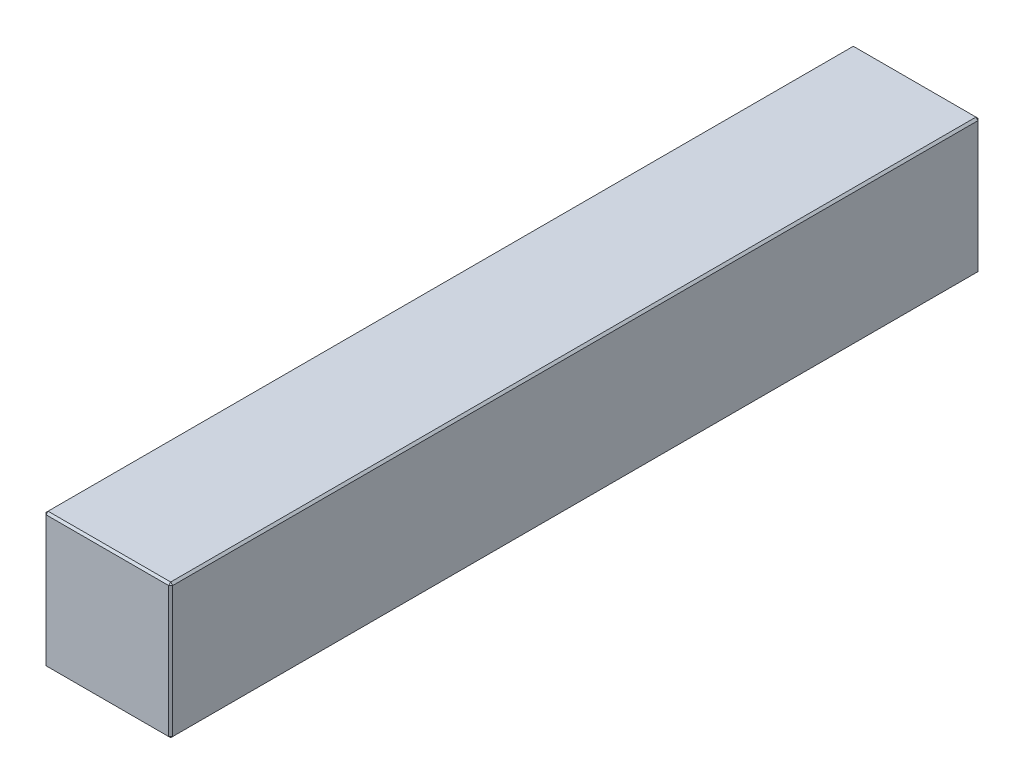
ISO-10303-21;
HEADER;
FILE_DESCRIPTION(('STEP AP214'),'2;1');
FILE_NAME('part.step','',(''),(''),'','','');
FILE_SCHEMA(('AUTOMOTIVE_DESIGN { 1 0 10303 214 1 1 1 1 }'));
ENDSEC;
DATA;
#1=APPLICATION_CONTEXT('core data for automotive mechanical design processes');
#2=APPLICATION_PROTOCOL_DEFINITION('international standard','automotive_design',2000,#1);
#3=PRODUCT_CONTEXT('',#1,'mechanical');
#4=PRODUCT('Part','Part','',(#3));
#5=PRODUCT_RELATED_PRODUCT_CATEGORY('part','',(#4));
#6=PRODUCT_DEFINITION_FORMATION('','',#4);
#7=PRODUCT_DEFINITION_CONTEXT('part definition',#1,'design');
#8=PRODUCT_DEFINITION('design','',#6,#7);
#9=PRODUCT_DEFINITION_SHAPE('','',#8);
#10=(LENGTH_UNIT() NAMED_UNIT(*) SI_UNIT(.MILLI.,.METRE.));
#11=(NAMED_UNIT(*) PLANE_ANGLE_UNIT() SI_UNIT($,.RADIAN.));
#12=(NAMED_UNIT(*) SI_UNIT($,.STERADIAN.) SOLID_ANGLE_UNIT());
#13=UNCERTAINTY_MEASURE_WITH_UNIT(LENGTH_MEASURE(1.E-05),#10,'distance_accuracy_value','');
#14=(GEOMETRIC_REPRESENTATION_CONTEXT(3) GLOBAL_UNCERTAINTY_ASSIGNED_CONTEXT((#13)) GLOBAL_UNIT_ASSIGNED_CONTEXT((#10,
#11,#12)) REPRESENTATION_CONTEXT('',''));
#15=CARTESIAN_POINT('',(0.,0.,0.));
#16=DIRECTION('',(0.,0.,1.));
#17=DIRECTION('',(1.,0.,0.));
#18=AXIS2_PLACEMENT_3D('',#15,#16,#17);
#19=CARTESIAN_POINT('',(-31.,66.,198.));
#20=DIRECTION('',(1.,0.,0.));
#21=DIRECTION('',(0.,0.,-1.));
#22=AXIS2_PLACEMENT_3D('',#19,#20,#21);
#23=PLANE('',#22);
#24=DIRECTION('',(0.,-1.,0.));
#25=VECTOR('',#24,1.);
#26=CARTESIAN_POINT('',(-31.,66.,-197.));
#27=LINE('',#26,#25);
#28=CARTESIAN_POINT('',(-31.,65.,-197.));
#29=VERTEX_POINT('',#28);
#30=CARTESIAN_POINT('',(-31.,1.,-197.));
#31=VERTEX_POINT('',#30);
#32=EDGE_CURVE('E115',#29,#31,#27,.T.);
#33=ORIENTED_EDGE('',*,*,#32,.T.);
#34=DIRECTION('',(0.,0.,1.));
#35=VECTOR('',#34,1.);
#36=CARTESIAN_POINT('',(-31.,1.,198.));
#37=LINE('',#36,#35);
#38=CARTESIAN_POINT('',(-31.,1.,197.));
#39=VERTEX_POINT('',#38);
#40=EDGE_CURVE('E111',#31,#39,#37,.T.);
#41=ORIENTED_EDGE('',*,*,#40,.T.);
#42=DIRECTION('',(0.,1.,0.));
#43=VECTOR('',#42,1.);
#44=CARTESIAN_POINT('',(-31.,66.,197.));
#45=LINE('',#44,#43);
#46=CARTESIAN_POINT('',(-31.,65.,197.));
#47=VERTEX_POINT('',#46);
#48=EDGE_CURVE('E104',#39,#47,#45,.T.);
#49=ORIENTED_EDGE('',*,*,#48,.T.);
#50=DIRECTION('',(0.,0.,-1.));
#51=VECTOR('',#50,1.);
#52=CARTESIAN_POINT('',(-31.,65.,-198.));
#53=LINE('',#52,#51);
#54=EDGE_CURVE('E108',#47,#29,#53,.T.);
#55=ORIENTED_EDGE('',*,*,#54,.T.);
#56=EDGE_LOOP('',(#33,#41,#49,#55));
#57=FACE_BOUND('',#56,.T.);
#58=ADVANCED_FACE('F16',(#57),#23,.F.);
#59=CARTESIAN_POINT('',(31.,66.,198.));
#60=DIRECTION('',(0.,0.,-1.));
#61=DIRECTION('',(-1.,0.,0.));
#62=AXIS2_PLACEMENT_3D('',#59,#60,#61);
#63=PLANE('',#62);
#64=DIRECTION('',(-1.,0.,0.));
#65=VECTOR('',#64,1.);
#66=CARTESIAN_POINT('',(-31.,65.,198.));
#67=LINE('',#66,#65);
#68=CARTESIAN_POINT('',(30.,65.,198.));
#69=VERTEX_POINT('',#68);
#70=CARTESIAN_POINT('',(-30.,65.,198.));
#71=VERTEX_POINT('',#70);
#72=EDGE_CURVE('E165',#69,#71,#67,.T.);
#73=ORIENTED_EDGE('',*,*,#72,.T.);
#74=DIRECTION('',(0.,-1.,0.));
#75=VECTOR('',#74,1.);
#76=CARTESIAN_POINT('',(-30.,66.,198.));
#77=LINE('',#76,#75);
#78=CARTESIAN_POINT('',(-30.,1.,198.));
#79=VERTEX_POINT('',#78);
#80=EDGE_CURVE('E123',#71,#79,#77,.T.);
#81=ORIENTED_EDGE('',*,*,#80,.T.);
#82=DIRECTION('',(1.,0.,0.));
#83=VECTOR('',#82,1.);
#84=CARTESIAN_POINT('',(31.,1.,198.));
#85=LINE('',#84,#83);
#86=CARTESIAN_POINT('',(30.,1.,198.));
#87=VERTEX_POINT('',#86);
#88=EDGE_CURVE('E169',#79,#87,#85,.T.);
#89=ORIENTED_EDGE('',*,*,#88,.T.);
#90=DIRECTION('',(0.,1.,0.));
#91=VECTOR('',#90,1.);
#92=CARTESIAN_POINT('',(30.,66.,198.));
#93=LINE('',#92,#91);
#94=EDGE_CURVE('E167',#87,#69,#93,.T.);
#95=ORIENTED_EDGE('',*,*,#94,.T.);
#96=EDGE_LOOP('',(#73,#81,#89,#95));
#97=FACE_BOUND('',#96,.T.);
#98=ADVANCED_FACE('F276',(#97),#63,.F.);
#99=CARTESIAN_POINT('',(31.,66.,198.));
#100=DIRECTION('',(-1.,0.,0.));
#101=DIRECTION('',(0.,0.,1.));
#102=AXIS2_PLACEMENT_3D('',#99,#100,#101);
#103=PLANE('',#102);
#104=DIRECTION('',(0.,0.,-1.));
#105=VECTOR('',#104,1.);
#106=CARTESIAN_POINT('',(31.,1.,198.));
#107=LINE('',#106,#105);
#108=CARTESIAN_POINT('',(31.,1.,197.));
#109=VERTEX_POINT('',#108);
#110=CARTESIAN_POINT('',(31.,1.,-197.));
#111=VERTEX_POINT('',#110);
#112=EDGE_CURVE('E160',#109,#111,#107,.T.);
#113=ORIENTED_EDGE('',*,*,#112,.T.);
#114=DIRECTION('',(0.,1.,0.));
#115=VECTOR('',#114,1.);
#116=CARTESIAN_POINT('',(31.,66.,-197.));
#117=LINE('',#116,#115);
#118=CARTESIAN_POINT('',(31.,65.,-197.));
#119=VERTEX_POINT('',#118);
#120=EDGE_CURVE('E162',#111,#119,#117,.T.);
#121=ORIENTED_EDGE('',*,*,#120,.T.);
#122=DIRECTION('',(0.,0.,1.));
#123=VECTOR('',#122,1.);
#124=CARTESIAN_POINT('',(31.,65.,198.));
#125=LINE('',#124,#123);
#126=CARTESIAN_POINT('',(31.,65.,197.));
#127=VERTEX_POINT('',#126);
#128=EDGE_CURVE('E156',#119,#127,#125,.T.);
#129=ORIENTED_EDGE('',*,*,#128,.T.);
#130=DIRECTION('',(0.,-1.,0.));
#131=VECTOR('',#130,1.);
#132=CARTESIAN_POINT('',(31.,66.,197.));
#133=LINE('',#132,#131);
#134=EDGE_CURVE('E158',#127,#109,#133,.T.);
#135=ORIENTED_EDGE('',*,*,#134,.T.);
#136=EDGE_LOOP('',(#113,#121,#129,#135));
#137=FACE_BOUND('',#136,.T.);
#138=ADVANCED_FACE('F255',(#137),#103,.F.);
#139=CARTESIAN_POINT('',(31.,66.,-198.));
#140=DIRECTION('',(0.,0.,1.));
#141=DIRECTION('',(1.,0.,0.));
#142=AXIS2_PLACEMENT_3D('',#139,#140,#141);
#143=PLANE('',#142);
#144=DIRECTION('',(0.,-1.,0.));
#145=VECTOR('',#144,1.);
#146=CARTESIAN_POINT('',(30.,66.,-198.));
#147=LINE('',#146,#145);
#148=CARTESIAN_POINT('',(30.,65.,-198.));
#149=VERTEX_POINT('',#148);
#150=CARTESIAN_POINT('',(30.,1.,-198.));
#151=VERTEX_POINT('',#150);
#152=EDGE_CURVE('E149',#149,#151,#147,.T.);
#153=ORIENTED_EDGE('',*,*,#152,.T.);
#154=DIRECTION('',(-1.,0.,0.));
#155=VECTOR('',#154,1.);
#156=CARTESIAN_POINT('',(31.,1.,-198.));
#157=LINE('',#156,#155);
#158=CARTESIAN_POINT('',(-30.,1.,-198.));
#159=VERTEX_POINT('',#158);
#160=EDGE_CURVE('E154',#151,#159,#157,.T.);
#161=ORIENTED_EDGE('',*,*,#160,.T.);
#162=DIRECTION('',(0.,1.,0.));
#163=VECTOR('',#162,1.);
#164=CARTESIAN_POINT('',(-30.,66.,-198.));
#165=LINE('',#164,#163);
#166=CARTESIAN_POINT('',(-30.,65.,-198.));
#167=VERTEX_POINT('',#166);
#168=EDGE_CURVE('E151',#159,#167,#165,.T.);
#169=ORIENTED_EDGE('',*,*,#168,.T.);
#170=DIRECTION('',(1.,0.,0.));
#171=VECTOR('',#170,1.);
#172=CARTESIAN_POINT('',(31.,65.,-198.));
#173=LINE('',#172,#171);
#174=EDGE_CURVE('E147',#167,#149,#173,.T.);
#175=ORIENTED_EDGE('',*,*,#174,.T.);
#176=EDGE_LOOP('',(#153,#161,#169,#175));
#177=FACE_BOUND('',#176,.T.);
#178=ADVANCED_FACE('F285',(#177),#143,.F.);
#179=CARTESIAN_POINT('',(0.,66.,0.));
#180=DIRECTION('',(0.,1.,0.));
#181=DIRECTION('',(0.,0.,1.));
#182=AXIS2_PLACEMENT_3D('',#179,#180,#181);
#183=PLANE('',#182);
#184=DIRECTION('',(0.,0.,-1.));
#185=VECTOR('',#184,1.);
#186=CARTESIAN_POINT('',(30.,66.,-198.));
#187=LINE('',#186,#185);
#188=CARTESIAN_POINT('',(30.,66.,197.));
#189=VERTEX_POINT('',#188);
#190=CARTESIAN_POINT('',(30.,66.,-197.));
#191=VERTEX_POINT('',#190);
#192=EDGE_CURVE('E25',#189,#191,#187,.T.);
#193=ORIENTED_EDGE('',*,*,#192,.T.);
#194=DIRECTION('',(-1.,0.,0.));
#195=VECTOR('',#194,1.);
#196=CARTESIAN_POINT('',(-31.,66.,-197.));
#197=LINE('',#196,#195);
#198=CARTESIAN_POINT('',(-30.,66.,-197.));
#199=VERTEX_POINT('',#198);
#200=EDGE_CURVE('E10',#191,#199,#197,.T.);
#201=ORIENTED_EDGE('',*,*,#200,.T.);
#202=DIRECTION('',(0.,0.,1.));
#203=VECTOR('',#202,1.);
#204=CARTESIAN_POINT('',(-30.,66.,198.));
#205=LINE('',#204,#203);
#206=CARTESIAN_POINT('',(-30.,66.,197.));
#207=VERTEX_POINT('',#206);
#208=EDGE_CURVE('E181',#199,#207,#205,.T.);
#209=ORIENTED_EDGE('',*,*,#208,.T.);
#210=DIRECTION('',(1.,0.,0.));
#211=VECTOR('',#210,1.);
#212=CARTESIAN_POINT('',(31.,66.,197.));
#213=LINE('',#212,#211);
#214=EDGE_CURVE('E36',#207,#189,#213,.T.);
#215=ORIENTED_EDGE('',*,*,#214,.T.);
#216=EDGE_LOOP('',(#193,#201,#209,#215));
#217=FACE_BOUND('',#216,.T.);
#218=ADVANCED_FACE('F351',(#217),#183,.T.);
#219=CARTESIAN_POINT('',(0.,0.,0.));
#220=DIRECTION('',(0.,1.,0.));
#221=DIRECTION('',(0.,0.,1.));
#222=AXIS2_PLACEMENT_3D('',#219,#220,#221);
#223=PLANE('',#222);
#224=DIRECTION('',(0.,0.,1.));
#225=VECTOR('',#224,1.);
#226=CARTESIAN_POINT('',(30.,0.,0.));
#227=LINE('',#226,#225);
#228=CARTESIAN_POINT('',(30.,0.,-197.));
#229=VERTEX_POINT('',#228);
#230=CARTESIAN_POINT('',(30.,0.,197.));
#231=VERTEX_POINT('',#230);
#232=EDGE_CURVE('E172',#229,#231,#227,.T.);
#233=ORIENTED_EDGE('',*,*,#232,.T.);
#234=DIRECTION('',(-1.,0.,0.));
#235=VECTOR('',#234,1.);
#236=CARTESIAN_POINT('',(0.,0.,197.));
#237=LINE('',#236,#235);
#238=CARTESIAN_POINT('',(-30.,0.,197.));
#239=VERTEX_POINT('',#238);
#240=EDGE_CURVE('E178',#231,#239,#237,.T.);
#241=ORIENTED_EDGE('',*,*,#240,.T.);
#242=DIRECTION('',(0.,0.,-1.));
#243=VECTOR('',#242,1.);
#244=CARTESIAN_POINT('',(-30.,0.,0.));
#245=LINE('',#244,#243);
#246=CARTESIAN_POINT('',(-30.,0.,-197.));
#247=VERTEX_POINT('',#246);
#248=EDGE_CURVE('E176',#239,#247,#245,.T.);
#249=ORIENTED_EDGE('',*,*,#248,.T.);
#250=DIRECTION('',(1.,0.,0.));
#251=VECTOR('',#250,1.);
#252=CARTESIAN_POINT('',(0.,0.,-197.));
#253=LINE('',#252,#251);
#254=EDGE_CURVE('E174',#247,#229,#253,.T.);
#255=ORIENTED_EDGE('',*,*,#254,.T.);
#256=EDGE_LOOP('',(#233,#241,#249,#255));
#257=FACE_BOUND('',#256,.T.);
#258=ADVANCED_FACE('F247',(#257),#223,.F.);
#259=CARTESIAN_POINT('',(31.,66.,197.));
#260=DIRECTION('',(-0.707106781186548,0.,-0.707106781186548));
#261=DIRECTION('',(0.,-1.,0.));
#262=AXIS2_PLACEMENT_3D('',#259,#260,#261);
#263=PLANE('',#262);
#264=DIRECTION('',(-0.707106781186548,0.,0.707106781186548));
#265=VECTOR('',#264,1.);
#266=CARTESIAN_POINT('',(30.,65.,198.));
#267=LINE('',#266,#265);
#268=EDGE_CURVE('E20',#69,#127,#267,.F.);
#269=ORIENTED_EDGE('',*,*,#268,.F.);
#270=ORIENTED_EDGE('',*,*,#94,.F.);
#271=DIRECTION('',(0.707106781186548,0.,-0.707106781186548));
#272=VECTOR('',#271,1.);
#273=CARTESIAN_POINT('',(30.,1.,198.));
#274=LINE('',#273,#272);
#275=EDGE_CURVE('E143',#109,#87,#274,.F.);
#276=ORIENTED_EDGE('',*,*,#275,.F.);
#277=ORIENTED_EDGE('',*,*,#134,.F.);
#278=EDGE_LOOP('',(#269,#270,#276,#277));
#279=FACE_BOUND('',#278,.T.);
#280=ADVANCED_FACE('F18',(#279),#263,.F.);
#281=CARTESIAN_POINT('',(30.,65.,198.));
#282=DIRECTION('',(0.577350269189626,0.577350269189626,0.577350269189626));
#283=DIRECTION('',(0.707106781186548,0.,-0.707106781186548));
#284=AXIS2_PLACEMENT_3D('',#281,#282,#283);
#285=PLANE('',#284);
#286=DIRECTION('',(0.,-0.707106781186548,0.707106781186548));
#287=VECTOR('',#286,1.);
#288=CARTESIAN_POINT('',(30.,65.,198.));
#289=LINE('',#288,#287);
#290=EDGE_CURVE('E227',#69,#189,#289,.F.);
#291=ORIENTED_EDGE('',*,*,#290,.F.);
#292=ORIENTED_EDGE('',*,*,#268,.T.);
#293=DIRECTION('',(-0.707106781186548,0.707106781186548,0.));
#294=VECTOR('',#293,1.);
#295=CARTESIAN_POINT('',(30.5,65.5,197.));
#296=LINE('',#295,#294);
#297=EDGE_CURVE('E229',#189,#127,#296,.F.);
#298=ORIENTED_EDGE('',*,*,#297,.F.);
#299=EDGE_LOOP('',(#291,#292,#298));
#300=FACE_BOUND('',#299,.T.);
#301=ADVANCED_FACE('F271',(#300),#285,.T.);
#302=CARTESIAN_POINT('',(30.,1.,198.));
#303=DIRECTION('',(0.577350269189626,-0.577350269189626,0.577350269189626));
#304=DIRECTION('',(0.707106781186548,0.,-0.707106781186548));
#305=AXIS2_PLACEMENT_3D('',#302,#303,#304);
#306=PLANE('',#305);
#307=DIRECTION('',(-0.707106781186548,-0.707106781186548,0.));
#308=VECTOR('',#307,1.);
#309=CARTESIAN_POINT('',(30.5,0.5,197.));
#310=LINE('',#309,#308);
#311=EDGE_CURVE('E221',#109,#231,#310,.T.);
#312=ORIENTED_EDGE('',*,*,#311,.F.);
#313=ORIENTED_EDGE('',*,*,#275,.T.);
#314=DIRECTION('',(0.,0.707106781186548,0.707106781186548));
#315=VECTOR('',#314,1.);
#316=CARTESIAN_POINT('',(30.,1.,198.));
#317=LINE('',#316,#315);
#318=EDGE_CURVE('E224',#231,#87,#317,.T.);
#319=ORIENTED_EDGE('',*,*,#318,.F.);
#320=EDGE_LOOP('',(#312,#313,#319));
#321=FACE_BOUND('',#320,.T.);
#322=ADVANCED_FACE('F236',(#321),#306,.T.);
#323=CARTESIAN_POINT('',(30.,66.,0.));
#324=DIRECTION('',(0.707106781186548,0.707106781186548,0.));
#325=DIRECTION('',(0.,0.,1.));
#326=AXIS2_PLACEMENT_3D('',#323,#324,#325);
#327=PLANE('',#326);
#328=ORIENTED_EDGE('',*,*,#297,.T.);
#329=ORIENTED_EDGE('',*,*,#128,.F.);
#330=DIRECTION('',(0.707106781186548,-0.707106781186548,0.));
#331=VECTOR('',#330,1.);
#332=CARTESIAN_POINT('',(31.,65.,-197.));
#333=LINE('',#332,#331);
#334=EDGE_CURVE('E216',#191,#119,#333,.T.);
#335=ORIENTED_EDGE('',*,*,#334,.F.);
#336=ORIENTED_EDGE('',*,*,#192,.F.);
#337=EDGE_LOOP('',(#328,#329,#335,#336));
#338=FACE_BOUND('',#337,.T.);
#339=ADVANCED_FACE('F266',(#338),#327,.T.);
#340=CARTESIAN_POINT('',(0.,66.,197.));
#341=DIRECTION('',(0.,0.707106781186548,0.707106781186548));
#342=DIRECTION('',(-1.,0.,0.));
#343=AXIS2_PLACEMENT_3D('',#340,#341,#342);
#344=PLANE('',#343);
#345=ORIENTED_EDGE('',*,*,#290,.T.);
#346=ORIENTED_EDGE('',*,*,#214,.F.);
#347=DIRECTION('',(0.,0.707106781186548,-0.707106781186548));
#348=VECTOR('',#347,1.);
#349=CARTESIAN_POINT('',(-30.,65.5,197.5));
#350=LINE('',#349,#348);
#351=EDGE_CURVE('E127',#71,#207,#350,.T.);
#352=ORIENTED_EDGE('',*,*,#351,.F.);
#353=ORIENTED_EDGE('',*,*,#72,.F.);
#354=EDGE_LOOP('',(#345,#346,#352,#353));
#355=FACE_BOUND('',#354,.T.);
#356=ADVANCED_FACE('F274',(#355),#344,.T.);
#357=CARTESIAN_POINT('',(-30.,66.,198.));
#358=DIRECTION('',(0.707106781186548,0.,-0.707106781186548));
#359=DIRECTION('',(0.,-1.,0.));
#360=AXIS2_PLACEMENT_3D('',#357,#358,#359);
#361=PLANE('',#360);
#362=DIRECTION('',(0.707106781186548,0.,0.707106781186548));
#363=VECTOR('',#362,1.);
#364=CARTESIAN_POINT('',(-30.,1.,198.));
#365=LINE('',#364,#363);
#366=EDGE_CURVE('E128',#79,#39,#365,.F.);
#367=ORIENTED_EDGE('',*,*,#366,.F.);
#368=ORIENTED_EDGE('',*,*,#80,.F.);
#369=DIRECTION('',(-0.707106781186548,0.,-0.707106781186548));
#370=VECTOR('',#369,1.);
#371=CARTESIAN_POINT('',(-31.,65.,197.));
#372=LINE('',#371,#370);
#373=EDGE_CURVE('E119',#47,#71,#372,.F.);
#374=ORIENTED_EDGE('',*,*,#373,.F.);
#375=ORIENTED_EDGE('',*,*,#48,.F.);
#376=EDGE_LOOP('',(#367,#368,#374,#375));
#377=FACE_BOUND('',#376,.T.);
#378=ADVANCED_FACE('F121',(#377),#361,.F.);
#379=CARTESIAN_POINT('',(31.,1.,198.));
#380=DIRECTION('',(0.,0.707106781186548,-0.707106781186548));
#381=DIRECTION('',(1.,0.,0.));
#382=AXIS2_PLACEMENT_3D('',#379,#380,#381);
#383=PLANE('',#382);
#384=ORIENTED_EDGE('',*,*,#318,.T.);
#385=ORIENTED_EDGE('',*,*,#88,.F.);
#386=DIRECTION('',(0.,-0.707106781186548,-0.707106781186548));
#387=VECTOR('',#386,1.);
#388=CARTESIAN_POINT('',(-30.,1.,198.));
#389=LINE('',#388,#387);
#390=EDGE_CURVE('E212',#239,#79,#389,.F.);
#391=ORIENTED_EDGE('',*,*,#390,.F.);
#392=ORIENTED_EDGE('',*,*,#240,.F.);
#393=EDGE_LOOP('',(#384,#385,#391,#392));
#394=FACE_BOUND('',#393,.T.);
#395=ADVANCED_FACE('F244',(#394),#383,.F.);
#396=CARTESIAN_POINT('',(31.,1.,198.));
#397=DIRECTION('',(-0.707106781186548,0.707106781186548,0.));
#398=DIRECTION('',(0.,0.,-1.));
#399=AXIS2_PLACEMENT_3D('',#396,#397,#398);
#400=PLANE('',#399);
#401=ORIENTED_EDGE('',*,*,#311,.T.);
#402=ORIENTED_EDGE('',*,*,#232,.F.);
#403=DIRECTION('',(0.707106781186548,0.707106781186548,0.));
#404=VECTOR('',#403,1.);
#405=CARTESIAN_POINT('',(30.5,0.5,-197.));
#406=LINE('',#405,#404);
#407=EDGE_CURVE('E209',#111,#229,#406,.F.);
#408=ORIENTED_EDGE('',*,*,#407,.F.);
#409=ORIENTED_EDGE('',*,*,#112,.F.);
#410=EDGE_LOOP('',(#401,#402,#408,#409));
#411=FACE_BOUND('',#410,.T.);
#412=ADVANCED_FACE('F252',(#411),#400,.F.);
#413=CARTESIAN_POINT('',(30.,66.,-198.));
#414=DIRECTION('',(-0.707106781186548,0.,0.707106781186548));
#415=DIRECTION('',(0.,-1.,0.));
#416=AXIS2_PLACEMENT_3D('',#413,#414,#415);
#417=PLANE('',#416);
#418=DIRECTION('',(0.707106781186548,0.,0.707106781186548));
#419=VECTOR('',#418,1.);
#420=CARTESIAN_POINT('',(31.,65.,-197.));
#421=LINE('',#420,#419);
#422=EDGE_CURVE('E218',#119,#149,#421,.F.);
#423=ORIENTED_EDGE('',*,*,#422,.F.);
#424=ORIENTED_EDGE('',*,*,#120,.F.);
#425=DIRECTION('',(-0.707106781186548,0.,-0.707106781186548));
#426=VECTOR('',#425,1.);
#427=CARTESIAN_POINT('',(30.,1.,-198.));
#428=LINE('',#427,#426);
#429=EDGE_CURVE('E206',#151,#111,#428,.F.);
#430=ORIENTED_EDGE('',*,*,#429,.F.);
#431=ORIENTED_EDGE('',*,*,#152,.F.);
#432=EDGE_LOOP('',(#423,#424,#430,#431));
#433=FACE_BOUND('',#432,.T.);
#434=ADVANCED_FACE('F259',(#433),#417,.F.);
#435=CARTESIAN_POINT('',(31.,65.,-197.));
#436=DIRECTION('',(0.577350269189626,0.577350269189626,-0.577350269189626));
#437=DIRECTION('',(-0.707106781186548,0.,-0.707106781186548));
#438=AXIS2_PLACEMENT_3D('',#435,#436,#437);
#439=PLANE('',#438);
#440=ORIENTED_EDGE('',*,*,#334,.T.);
#441=ORIENTED_EDGE('',*,*,#422,.T.);
#442=DIRECTION('',(0.,0.707106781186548,0.707106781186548));
#443=VECTOR('',#442,1.);
#444=CARTESIAN_POINT('',(30.,65.5,-197.5));
#445=LINE('',#444,#443);
#446=EDGE_CURVE('E135',#191,#149,#445,.F.);
#447=ORIENTED_EDGE('',*,*,#446,.F.);
#448=EDGE_LOOP('',(#440,#441,#447));
#449=FACE_BOUND('',#448,.T.);
#450=ADVANCED_FACE('F326',(#449),#439,.T.);
#451=CARTESIAN_POINT('',(-31.,65.,197.));
#452=DIRECTION('',(-0.577350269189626,0.577350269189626,0.577350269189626));
#453=DIRECTION('',(0.707106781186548,0.,0.707106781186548));
#454=AXIS2_PLACEMENT_3D('',#451,#452,#453);
#455=PLANE('',#454);
#456=ORIENTED_EDGE('',*,*,#373,.T.);
#457=ORIENTED_EDGE('',*,*,#351,.T.);
#458=DIRECTION('',(-0.707106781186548,-0.707106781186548,0.));
#459=VECTOR('',#458,1.);
#460=CARTESIAN_POINT('',(-31.,65.,197.));
#461=LINE('',#460,#459);
#462=EDGE_CURVE('E131',#47,#207,#461,.F.);
#463=ORIENTED_EDGE('',*,*,#462,.F.);
#464=EDGE_LOOP('',(#456,#457,#463));
#465=FACE_BOUND('',#464,.T.);
#466=ADVANCED_FACE('F132',(#465),#455,.T.);
#467=CARTESIAN_POINT('',(-30.,1.,198.));
#468=DIRECTION('',(-0.577350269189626,-0.577350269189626,0.577350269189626));
#469=DIRECTION('',(0.707106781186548,0.,0.707106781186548));
#470=AXIS2_PLACEMENT_3D('',#467,#468,#469);
#471=PLANE('',#470);
#472=ORIENTED_EDGE('',*,*,#390,.T.);
#473=ORIENTED_EDGE('',*,*,#366,.T.);
#474=DIRECTION('',(-0.707106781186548,0.707106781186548,0.));
#475=VECTOR('',#474,1.);
#476=CARTESIAN_POINT('',(-30.5,0.5,197.));
#477=LINE('',#476,#475);
#478=EDGE_CURVE('E136',#239,#39,#477,.T.);
#479=ORIENTED_EDGE('',*,*,#478,.F.);
#480=EDGE_LOOP('',(#472,#473,#479));
#481=FACE_BOUND('',#480,.T.);
#482=ADVANCED_FACE('F319',(#481),#471,.T.);
#483=CARTESIAN_POINT('',(30.,1.,-198.));
#484=DIRECTION('',(0.577350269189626,-0.577350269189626,-0.577350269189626));
#485=DIRECTION('',(-0.707106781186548,0.,-0.707106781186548));
#486=AXIS2_PLACEMENT_3D('',#483,#484,#485);
#487=PLANE('',#486);
#488=ORIENTED_EDGE('',*,*,#429,.T.);
#489=ORIENTED_EDGE('',*,*,#407,.T.);
#490=DIRECTION('',(0.,-0.707106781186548,0.707106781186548));
#491=VECTOR('',#490,1.);
#492=CARTESIAN_POINT('',(30.,1.,-198.));
#493=LINE('',#492,#491);
#494=EDGE_CURVE('E199',#151,#229,#493,.T.);
#495=ORIENTED_EDGE('',*,*,#494,.F.);
#496=EDGE_LOOP('',(#488,#489,#495));
#497=FACE_BOUND('',#496,.T.);
#498=ADVANCED_FACE('F315',(#497),#487,.T.);
#499=CARTESIAN_POINT('',(0.,66.,-197.));
#500=DIRECTION('',(0.,0.707106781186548,-0.707106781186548));
#501=DIRECTION('',(1.,0.,0.));
#502=AXIS2_PLACEMENT_3D('',#499,#500,#501);
#503=PLANE('',#502);
#504=ORIENTED_EDGE('',*,*,#446,.T.);
#505=ORIENTED_EDGE('',*,*,#174,.F.);
#506=DIRECTION('',(0.,-0.707106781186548,-0.707106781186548));
#507=VECTOR('',#506,1.);
#508=CARTESIAN_POINT('',(-30.,65.,-198.));
#509=LINE('',#508,#507);
#510=EDGE_CURVE('E196',#199,#167,#509,.T.);
#511=ORIENTED_EDGE('',*,*,#510,.F.);
#512=ORIENTED_EDGE('',*,*,#200,.F.);
#513=EDGE_LOOP('',(#504,#505,#511,#512));
#514=FACE_BOUND('',#513,.T.);
#515=ADVANCED_FACE('F312',(#514),#503,.T.);
#516=CARTESIAN_POINT('',(-30.,66.,0.));
#517=DIRECTION('',(-0.707106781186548,0.707106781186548,0.));
#518=DIRECTION('',(0.,0.,-1.));
#519=AXIS2_PLACEMENT_3D('',#516,#517,#518);
#520=PLANE('',#519);
#521=ORIENTED_EDGE('',*,*,#462,.T.);
#522=ORIENTED_EDGE('',*,*,#208,.F.);
#523=DIRECTION('',(0.707106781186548,0.707106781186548,0.));
#524=VECTOR('',#523,1.);
#525=CARTESIAN_POINT('',(-30.5,65.5,-197.));
#526=LINE('',#525,#524);
#527=EDGE_CURVE('E139',#29,#199,#526,.T.);
#528=ORIENTED_EDGE('',*,*,#527,.F.);
#529=ORIENTED_EDGE('',*,*,#54,.F.);
#530=EDGE_LOOP('',(#521,#522,#528,#529));
#531=FACE_BOUND('',#530,.T.);
#532=ADVANCED_FACE('F138',(#531),#520,.T.);
#533=CARTESIAN_POINT('',(-31.,1.,198.));
#534=DIRECTION('',(0.707106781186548,0.707106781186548,0.));
#535=DIRECTION('',(0.,0.,1.));
#536=AXIS2_PLACEMENT_3D('',#533,#534,#535);
#537=PLANE('',#536);
#538=ORIENTED_EDGE('',*,*,#478,.T.);
#539=ORIENTED_EDGE('',*,*,#40,.F.);
#540=DIRECTION('',(0.707106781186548,-0.707106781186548,0.));
#541=VECTOR('',#540,1.);
#542=CARTESIAN_POINT('',(-31.,1.,-197.));
#543=LINE('',#542,#541);
#544=EDGE_CURVE('E192',#247,#31,#543,.F.);
#545=ORIENTED_EDGE('',*,*,#544,.F.);
#546=ORIENTED_EDGE('',*,*,#248,.F.);
#547=EDGE_LOOP('',(#538,#539,#545,#546));
#548=FACE_BOUND('',#547,.T.);
#549=ADVANCED_FACE('F305',(#548),#537,.F.);
#550=CARTESIAN_POINT('',(31.,1.,-198.));
#551=DIRECTION('',(0.,0.707106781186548,0.707106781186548));
#552=DIRECTION('',(-1.,0.,0.));
#553=AXIS2_PLACEMENT_3D('',#550,#551,#552);
#554=PLANE('',#553);
#555=ORIENTED_EDGE('',*,*,#494,.T.);
#556=ORIENTED_EDGE('',*,*,#254,.F.);
#557=DIRECTION('',(0.,0.707106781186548,-0.707106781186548));
#558=VECTOR('',#557,1.);
#559=CARTESIAN_POINT('',(-30.,0.5,-197.5));
#560=LINE('',#559,#558);
#561=EDGE_CURVE('E189',#159,#247,#560,.F.);
#562=ORIENTED_EDGE('',*,*,#561,.F.);
#563=ORIENTED_EDGE('',*,*,#160,.F.);
#564=EDGE_LOOP('',(#555,#556,#562,#563));
#565=FACE_BOUND('',#564,.T.);
#566=ADVANCED_FACE('F301',(#565),#554,.F.);
#567=CARTESIAN_POINT('',(-30.,65.,-198.));
#568=DIRECTION('',(-0.577350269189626,0.577350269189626,-0.577350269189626));
#569=DIRECTION('',(-0.707106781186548,0.,0.707106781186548));
#570=AXIS2_PLACEMENT_3D('',#567,#568,#569);
#571=PLANE('',#570);
#572=ORIENTED_EDGE('',*,*,#527,.T.);
#573=ORIENTED_EDGE('',*,*,#510,.T.);
#574=DIRECTION('',(0.707106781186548,0.,-0.707106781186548));
#575=VECTOR('',#574,1.);
#576=CARTESIAN_POINT('',(-30.,65.,-198.));
#577=LINE('',#576,#575);
#578=EDGE_CURVE('E187',#29,#167,#577,.T.);
#579=ORIENTED_EDGE('',*,*,#578,.F.);
#580=EDGE_LOOP('',(#572,#573,#579));
#581=FACE_BOUND('',#580,.T.);
#582=ADVANCED_FACE('F297',(#581),#571,.T.);
#583=CARTESIAN_POINT('',(-31.,1.,-197.));
#584=DIRECTION('',(-0.577350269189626,-0.577350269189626,-0.577350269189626));
#585=DIRECTION('',(-0.707106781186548,0.,0.707106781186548));
#586=AXIS2_PLACEMENT_3D('',#583,#584,#585);
#587=PLANE('',#586);
#588=ORIENTED_EDGE('',*,*,#561,.T.);
#589=ORIENTED_EDGE('',*,*,#544,.T.);
#590=DIRECTION('',(-0.707106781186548,0.,0.707106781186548));
#591=VECTOR('',#590,1.);
#592=CARTESIAN_POINT('',(-31.,1.,-197.));
#593=LINE('',#592,#591);
#594=EDGE_CURVE('E185',#159,#31,#593,.T.);
#595=ORIENTED_EDGE('',*,*,#594,.F.);
#596=EDGE_LOOP('',(#588,#589,#595));
#597=FACE_BOUND('',#596,.T.);
#598=ADVANCED_FACE('F293',(#597),#587,.T.);
#599=CARTESIAN_POINT('',(-31.,66.,-197.));
#600=DIRECTION('',(0.707106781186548,0.,0.707106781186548));
#601=DIRECTION('',(0.,-1.,0.));
#602=AXIS2_PLACEMENT_3D('',#599,#600,#601);
#603=PLANE('',#602);
#604=ORIENTED_EDGE('',*,*,#578,.T.);
#605=ORIENTED_EDGE('',*,*,#168,.F.);
#606=ORIENTED_EDGE('',*,*,#594,.T.);
#607=ORIENTED_EDGE('',*,*,#32,.F.);
#608=EDGE_LOOP('',(#604,#605,#606,#607));
#609=FACE_BOUND('',#608,.T.);
#610=ADVANCED_FACE('F290',(#609),#603,.F.);
#611=CLOSED_SHELL('',(#58,#98,#138,#178,#218,#258,#280,#301,#322,#339,#356,#378,#395,#412,#434,
#450,#466,#482,#498,#515,#532,#549,#566,#582,#598,#610));
#612=MANIFOLD_SOLID_BREP('B1',#611);
#613=ADVANCED_BREP_SHAPE_REPRESENTATION('',(#18,#612),#14);
#614=SHAPE_DEFINITION_REPRESENTATION(#9,#613);
ENDSEC;
END-ISO-10303-21;
